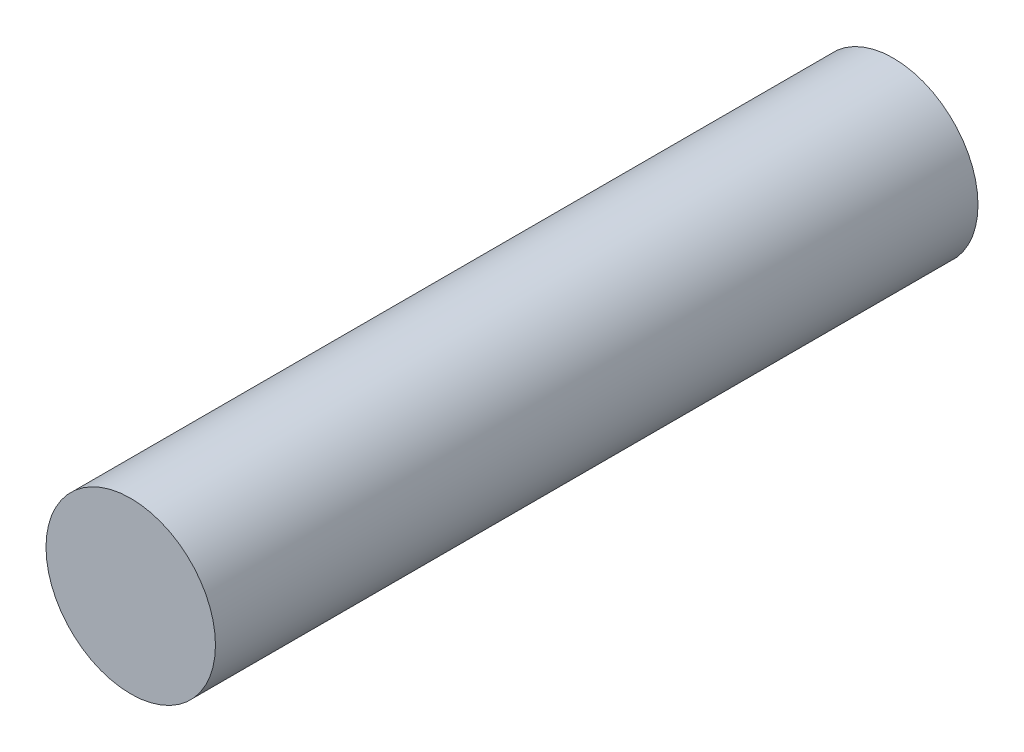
from build123d import *

# Parameters (mm, degrees)
ESQUISSE1_R      = 20
EXTRUSION1_DEPTH = 180


with BuildPart() as part:
    # Esquisse1 → Extrusion1 (new body)
    with BuildSketch(Plane.XY):
        with Locations(Location((0, 0, 0), (0, 0, 180))):
            Circle(ESQUISSE1_R)
    extrude(amount=EXTRUSION1_DEPTH)


solid = part.part
